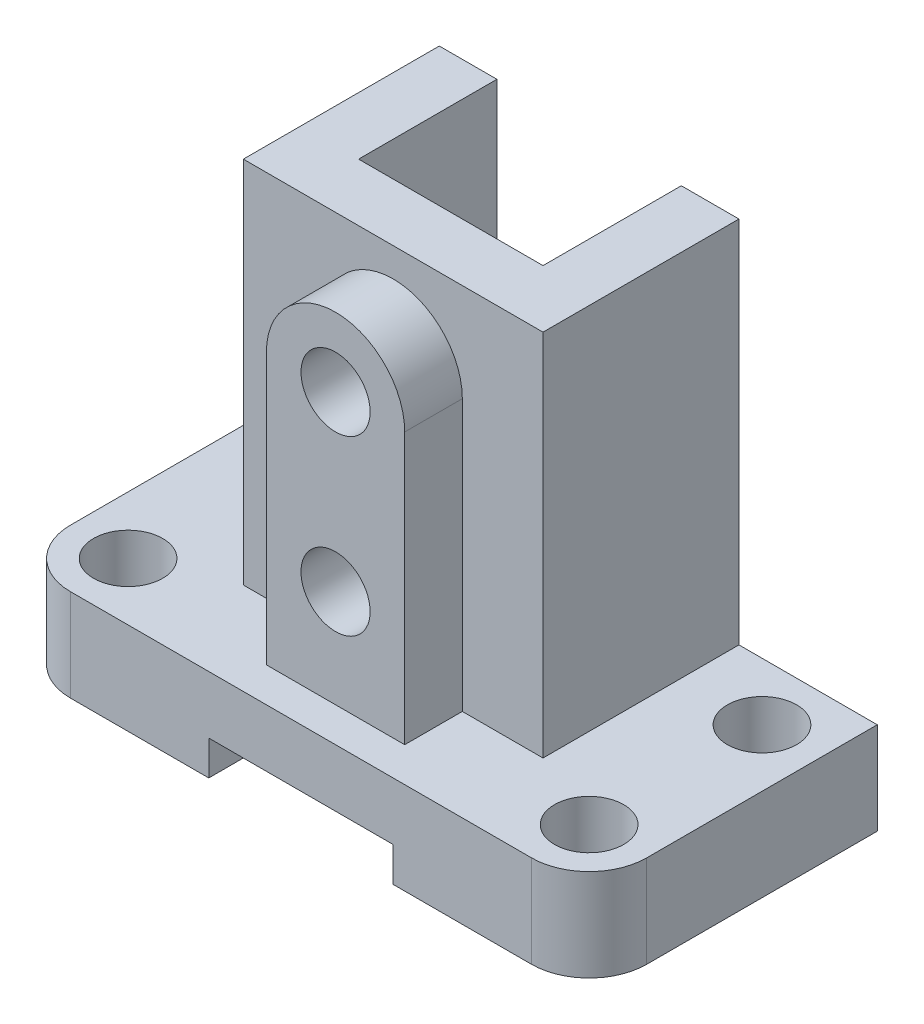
from build123d import *

# Parameters (mm, degrees)
EXTRUDE_1_DEPTH     = 32
SKETCH_2_R          = 12
CUT_EXTRUDE_1_DEPTH = 119.303264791
EXTRUDE_2_DEPTH     = 128
SKETCH_4_W          = 64
SKETCH_4_H          = 48
CUT_EXTRUDE_2_DEPTH = 172.334942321
EXTRUDE_3_DEPTH     = 20
SKETCH_6_R          = 12
CUT_EXTRUDE_3_DEPTH = 209.192218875
SKETCH_7_W          = 64
SKETCH_7_H          = 20.00295437
CUT_EXTRUDE_4_DEPTH = 214.541565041


with BuildPart() as part:
    # Sketch 1 → Extrude 1 (new body)
    with BuildSketch(Plane(origin=(0, 0, 0), x_dir=(1, 0, 0), z_dir=(0, 1, 0))):
        with BuildLine():
            Line((-100, 45.487043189), (100, 45.487043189))
            Line((100, 45.487043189), (100, -34.512956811))
            ThreePointArc((100, -34.512956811), (94.142135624, -48.655092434), (80, -54.512956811))
            Line((80, -54.512956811), (-80, -54.512956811))
            ThreePointArc((-80, -54.512956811), (-94.142135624, -48.655092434), (-100, -34.512956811))
            Line((-100, -34.512956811), (-100, 45.487043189))
        make_face()
    extrude(amount=EXTRUDE_1_DEPTH)

    # Sketch 2 → Cut-Extrude 1 (cut, through all)
    with BuildSketch(Plane(origin=(0, 32, 0), x_dir=(1, 0, 0), z_dir=(0, 1, 0))):
        with Locations(Location((80, -34.512956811, 0), (0, 0, 270))):
            Circle(SKETCH_2_R)
        with Locations(Location((80, 25.487043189, 0), (0, 0, 270))):
            Circle(SKETCH_2_R)
    cut_extrude_1 = extrude(amount=-CUT_EXTRUDE_1_DEPTH, mode=Mode.SUBTRACT)

    # Mirror 1: Cut-Extrude 1 across plane
    add(cut_extrude_1.mirror(Plane(origin=(0, 0, 0), x_dir=(0, 0, 1), z_dir=(1, 0, 0))), mode=Mode.SUBTRACT)

    # Sketch 3 → Extrude 2 (add)
    with BuildSketch(Plane(origin=(0, 32, 0), x_dir=(1, 0, 0), z_dir=(0, 1, 0))):
        Polygon((-52, 45.487043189), (-52, -22.512956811), (52, -22.512956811), (52, 45.487043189), (32, 45.487043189), (32, -2.512956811), (-32, -2.512956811), (-32, 45.487043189), align=None)
    extrude(amount=EXTRUDE_2_DEPTH)

    # Sketch 4 → Cut-Extrude 2 (cut, through all)
    with BuildSketch(Plane(origin=(0, 32, 0), x_dir=(1, 0, 0), z_dir=(0, 1, 0))):
        with Locations((0, 21.487043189)):
            Rectangle(SKETCH_4_W, SKETCH_4_H)
    extrude(amount=-CUT_EXTRUDE_2_DEPTH, mode=Mode.SUBTRACT)

    # Sketch 5 → Extrude 3 (add)
    with BuildSketch(Plane.XY.offset(22.512956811)):
        with BuildLine():
            Line((-24, 32), (-24, 126))
            ThreePointArc((-24, 126), (0, 150), (24, 126))
            Line((24, 126), (24, 32))
            Line((24, 32), (-24, 32))
        make_face()
    extrude(amount=EXTRUDE_3_DEPTH)

    # Sketch 6 → Cut-Extrude 3 (cut, through all)
    with BuildSketch(Plane.XY.offset(42.512956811)):
        with Locations((0, 126)):
            Circle(SKETCH_6_R)
        with Locations((0, 66)):
            Circle(SKETCH_6_R)
    extrude(amount=-CUT_EXTRUDE_3_DEPTH, mode=Mode.SUBTRACT)

    # Sketch 7 → Cut-Extrude 4 (cut, through all)
    with BuildSketch(Plane.XY.offset(54.512956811)):
        with Locations((0, 1.998522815)):
            Rectangle(SKETCH_7_W, SKETCH_7_H)
    extrude(amount=-CUT_EXTRUDE_4_DEPTH, mode=Mode.SUBTRACT)


solid = part.part
